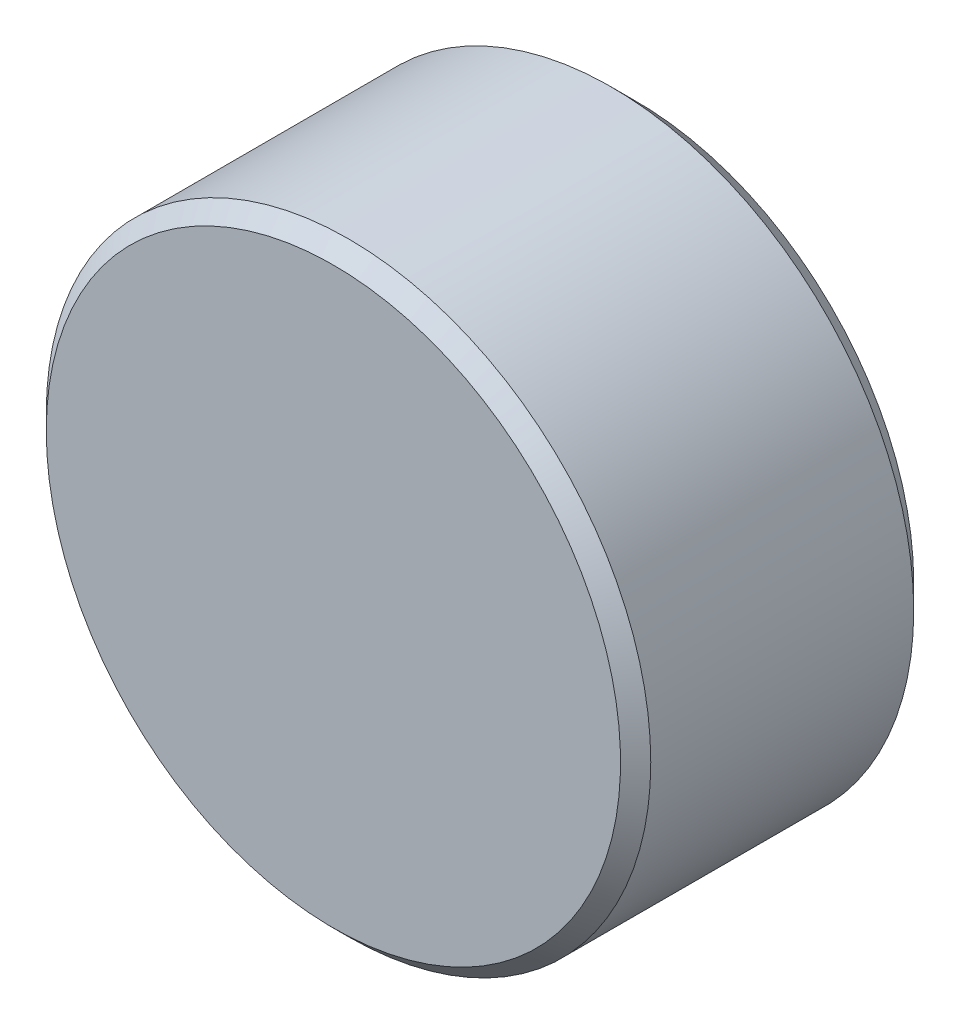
ISO-10303-21;
HEADER;
FILE_DESCRIPTION(('STEP AP214'),'2;1');
FILE_NAME('part.step','',(''),(''),'','','');
FILE_SCHEMA(('AUTOMOTIVE_DESIGN { 1 0 10303 214 1 1 1 1 }'));
ENDSEC;
DATA;
#1=APPLICATION_CONTEXT('core data for automotive mechanical design processes');
#2=APPLICATION_PROTOCOL_DEFINITION('international standard','automotive_design',2000,#1);
#3=PRODUCT_CONTEXT('',#1,'mechanical');
#4=PRODUCT('Part','Part','',(#3));
#5=PRODUCT_RELATED_PRODUCT_CATEGORY('part','',(#4));
#6=PRODUCT_DEFINITION_FORMATION('','',#4);
#7=PRODUCT_DEFINITION_CONTEXT('part definition',#1,'design');
#8=PRODUCT_DEFINITION('design','',#6,#7);
#9=PRODUCT_DEFINITION_SHAPE('','',#8);
#10=(LENGTH_UNIT() NAMED_UNIT(*) SI_UNIT(.MILLI.,.METRE.));
#11=(NAMED_UNIT(*) PLANE_ANGLE_UNIT() SI_UNIT($,.RADIAN.));
#12=(NAMED_UNIT(*) SI_UNIT($,.STERADIAN.) SOLID_ANGLE_UNIT());
#13=UNCERTAINTY_MEASURE_WITH_UNIT(LENGTH_MEASURE(1.E-05),#10,'distance_accuracy_value','');
#14=(GEOMETRIC_REPRESENTATION_CONTEXT(3) GLOBAL_UNCERTAINTY_ASSIGNED_CONTEXT((#13)) GLOBAL_UNIT_ASSIGNED_CONTEXT((#10,
#11,#12)) REPRESENTATION_CONTEXT('',''));
#15=CARTESIAN_POINT('',(0.,0.,0.));
#16=DIRECTION('',(0.,0.,1.));
#17=DIRECTION('',(1.,0.,0.));
#18=AXIS2_PLACEMENT_3D('',#15,#16,#17);
#19=CARTESIAN_POINT('',(0.,0.,30.));
#20=DIRECTION('',(0.,0.,1.));
#21=DIRECTION('',(1.,0.,0.));
#22=AXIS2_PLACEMENT_3D('',#19,#20,#21);
#23=CYLINDRICAL_SURFACE('',#22,10.);
#24=CARTESIAN_POINT('',(0.,0.,0.8));
#25=DIRECTION('',(0.,0.,1.));
#26=DIRECTION('',(1.,0.,0.));
#27=AXIS2_PLACEMENT_3D('',#24,#25,#26);
#28=CIRCLE('',#27,10.);
#29=CARTESIAN_POINT('',(10.,0.,0.8));
#30=VERTEX_POINT('',#29);
#31=EDGE_CURVE('E19',#30,#30,#28,.T.);
#32=ORIENTED_EDGE('',*,*,#31,.T.);
#33=EDGE_LOOP('',(#32));
#34=FACE_BOUND('',#33,.T.);
#35=CARTESIAN_POINT('',(0.,0.,9.5));
#36=DIRECTION('',(0.,0.,-1.));
#37=DIRECTION('',(-1.,0.,0.));
#38=AXIS2_PLACEMENT_3D('',#35,#36,#37);
#39=CIRCLE('',#38,10.);
#40=CARTESIAN_POINT('',(-10.,0.,9.5));
#41=VERTEX_POINT('',#40);
#42=EDGE_CURVE('E23',#41,#41,#39,.T.);
#43=ORIENTED_EDGE('',*,*,#42,.T.);
#44=EDGE_LOOP('',(#43));
#45=FACE_BOUND('',#44,.T.);
#46=ADVANCED_FACE('F12',(#34,#45),#23,.T.);
#47=CARTESIAN_POINT('',(10.,0.,10.));
#48=DIRECTION('',(0.,0.,-1.));
#49=DIRECTION('',(-1.,0.,0.));
#50=AXIS2_PLACEMENT_3D('',#47,#48,#49);
#51=PLANE('',#50);
#52=CARTESIAN_POINT('',(0.,0.,10.));
#53=DIRECTION('',(0.,0.,-1.));
#54=DIRECTION('',(-1.,0.,0.));
#55=AXIS2_PLACEMENT_3D('',#52,#53,#54);
#56=CIRCLE('',#55,9.5);
#57=CARTESIAN_POINT('',(-9.5,0.,10.));
#58=VERTEX_POINT('',#57);
#59=EDGE_CURVE('E27',#58,#58,#56,.F.);
#60=ORIENTED_EDGE('',*,*,#59,.T.);
#61=EDGE_LOOP('',(#60));
#62=FACE_BOUND('',#61,.T.);
#63=ADVANCED_FACE('F49',(#62),#51,.F.);
#64=CARTESIAN_POINT('',(0.,0.,5.));
#65=DIRECTION('',(0.,0.,1.));
#66=DIRECTION('',(1.,0.,0.));
#67=AXIS2_PLACEMENT_3D('',#64,#65,#66);
#68=PLANE('',#67);
#69=CARTESIAN_POINT('',(0.,0.,5.));
#70=DIRECTION('',(0.,0.,1.));
#71=DIRECTION('',(1.,0.,0.));
#72=AXIS2_PLACEMENT_3D('',#69,#70,#71);
#73=CIRCLE('',#72,3.);
#74=CARTESIAN_POINT('',(3.,0.,5.));
#75=VERTEX_POINT('',#74);
#76=EDGE_CURVE('E32',#75,#75,#73,.T.);
#77=ORIENTED_EDGE('',*,*,#76,.F.);
#78=EDGE_LOOP('',(#77));
#79=FACE_BOUND('',#78,.T.);
#80=ADVANCED_FACE('F44',(#79),#68,.F.);
#81=CARTESIAN_POINT('',(0.,0.,30.));
#82=DIRECTION('',(0.,0.,1.));
#83=DIRECTION('',(1.,0.,0.));
#84=AXIS2_PLACEMENT_3D('',#81,#82,#83);
#85=CYLINDRICAL_SURFACE('',#84,3.);
#86=CARTESIAN_POINT('',(0.,0.,0.));
#87=DIRECTION('',(0.,0.,1.));
#88=DIRECTION('',(1.,0.,0.));
#89=AXIS2_PLACEMENT_3D('',#86,#87,#88);
#90=CIRCLE('',#89,3.);
#91=CARTESIAN_POINT('',(3.,0.,0.));
#92=VERTEX_POINT('',#91);
#93=EDGE_CURVE('E35',#92,#92,#90,.T.);
#94=ORIENTED_EDGE('',*,*,#93,.F.);
#95=EDGE_LOOP('',(#94));
#96=FACE_BOUND('',#95,.T.);
#97=ORIENTED_EDGE('',*,*,#76,.T.);
#98=EDGE_LOOP('',(#97));
#99=FACE_BOUND('',#98,.T.);
#100=ADVANCED_FACE('F41',(#96,#99),#85,.F.);
#101=CARTESIAN_POINT('',(3.,0.,0.));
#102=DIRECTION('',(0.,0.,1.));
#103=DIRECTION('',(1.,0.,0.));
#104=AXIS2_PLACEMENT_3D('',#101,#102,#103);
#105=PLANE('',#104);
#106=CARTESIAN_POINT('',(0.,0.,0.));
#107=DIRECTION('',(0.,0.,1.));
#108=DIRECTION('',(1.,0.,0.));
#109=AXIS2_PLACEMENT_3D('',#106,#107,#108);
#110=CIRCLE('',#109,9.2);
#111=CARTESIAN_POINT('',(9.2,0.,0.));
#112=VERTEX_POINT('',#111);
#113=EDGE_CURVE('E8',#112,#112,#110,.F.);
#114=ORIENTED_EDGE('',*,*,#113,.T.);
#115=EDGE_LOOP('',(#114));
#116=FACE_BOUND('',#115,.T.);
#117=ORIENTED_EDGE('',*,*,#93,.T.);
#118=EDGE_LOOP('',(#117));
#119=FACE_BOUND('',#118,.T.);
#120=ADVANCED_FACE('F39',(#116,#119),#105,.F.);
#121=CARTESIAN_POINT('',(0.,0.,10.));
#122=DIRECTION('',(0.,0.,-1.));
#123=DIRECTION('',(-1.,0.,0.));
#124=AXIS2_PLACEMENT_3D('',#121,#122,#123);
#125=CONICAL_SURFACE('',#124,9.5,0.785398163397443);
#126=ORIENTED_EDGE('',*,*,#42,.F.);
#127=EDGE_LOOP('',(#126));
#128=FACE_BOUND('',#127,.T.);
#129=ORIENTED_EDGE('',*,*,#59,.F.);
#130=EDGE_LOOP('',(#129));
#131=FACE_BOUND('',#130,.T.);
#132=ADVANCED_FACE('F64',(#128,#131),#125,.T.);
#133=CARTESIAN_POINT('',(0.,0.,0.8));
#134=DIRECTION('',(0.,0.,1.));
#135=DIRECTION('',(1.,0.,0.));
#136=AXIS2_PLACEMENT_3D('',#133,#134,#135);
#137=CONICAL_SURFACE('',#136,10.,0.785398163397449);
#138=ORIENTED_EDGE('',*,*,#113,.F.);
#139=EDGE_LOOP('',(#138));
#140=FACE_BOUND('',#139,.T.);
#141=ORIENTED_EDGE('',*,*,#31,.F.);
#142=EDGE_LOOP('',(#141));
#143=FACE_BOUND('',#142,.T.);
#144=ADVANCED_FACE('F14',(#140,#143),#137,.T.);
#145=CLOSED_SHELL('',(#46,#63,#80,#100,#120,#132,#144));
#146=MANIFOLD_SOLID_BREP('B1',#145);
#147=ADVANCED_BREP_SHAPE_REPRESENTATION('',(#18,#146),#14);
#148=SHAPE_DEFINITION_REPRESENTATION(#9,#147);
ENDSEC;
END-ISO-10303-21;
